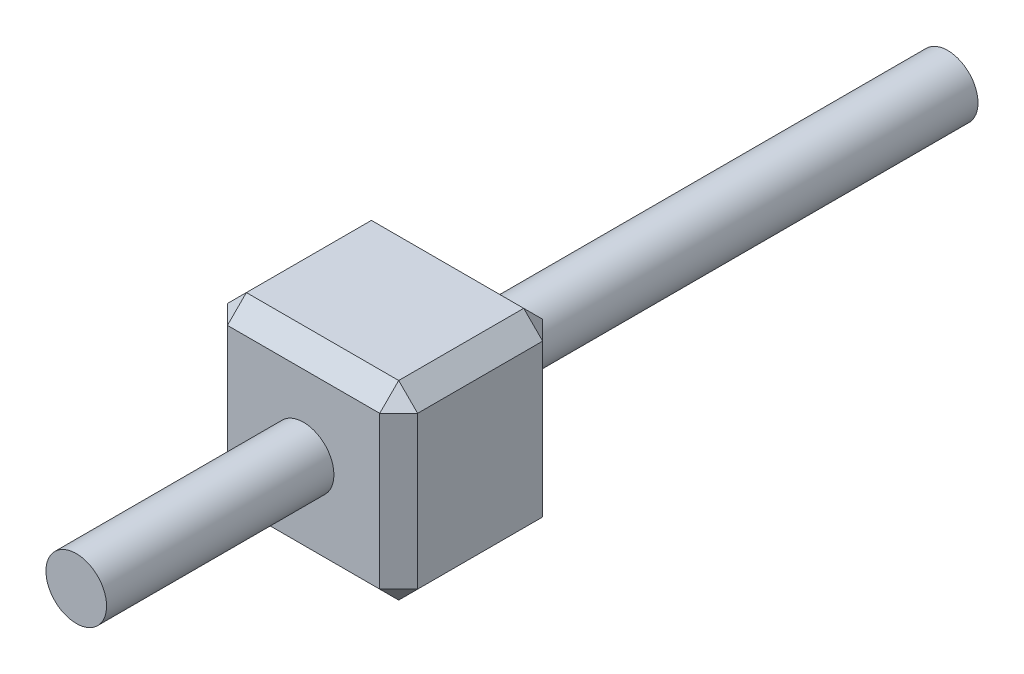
from build123d import *

# Parameters (mm, degrees)
ESQUISSE1_W           = 2.51
ESQUISSE1_H           = 2.51
EXTRUSION1_DEPTH      = 2.15
EXTRUSION2_DEPTH      = 3
EXTRUSION2_DEPTH_BACK = 8.5
ESQUISSE2_R           = 0.4
CHANFREIN1_SIZE       = 0.25


with BuildPart() as part:
    # Esquisse1 → Extrusion1 (new body)
    with BuildSketch(Plane.XY):
        with Locations((-29.245415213, 23.064714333)):
            Rectangle(ESQUISSE1_W, ESQUISSE1_H)
    extrude(amount=EXTRUSION1_DEPTH)

    # Esquisse2 → Extrusion2 (add, two sides: drawn at the far end of the back side and taken through both)
    with BuildSketch(Plane.XY.offset(2.15).offset(-EXTRUSION2_DEPTH_BACK)):
        with Locations((-29.245415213, 23.064714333)):
            Circle(ESQUISSE2_R)
    extrude(amount=EXTRUSION2_DEPTH + EXTRUSION2_DEPTH_BACK)

    # Chanfrein1
    chanfrein1_edges = [part.edges().sort_by_distance(p)[0] for p in [
        (-27.990415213, 23.064714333, 2.15),
        (-29.245415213, 24.319714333, 2.15),
        (-30.500415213, 23.064714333, 2.15),
        (-29.245415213, 24.319714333, 0),
        (-27.990415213, 23.064714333, 0),
        (-29.245415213, 21.809714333, 0),
        (-30.500415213, 23.064714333, 0),
        (-29.245415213, 21.809714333, 2.15),
        (-30.500415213, 24.319714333, 1.075),
        (-27.990415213, 24.319714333, 1.075),
        (-27.990415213, 21.809714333, 1.075),
        (-30.500415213, 21.809714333, 1.075),
    ]]
    chamfer(chanfrein1_edges, length=CHANFREIN1_SIZE)


solid = part.part
